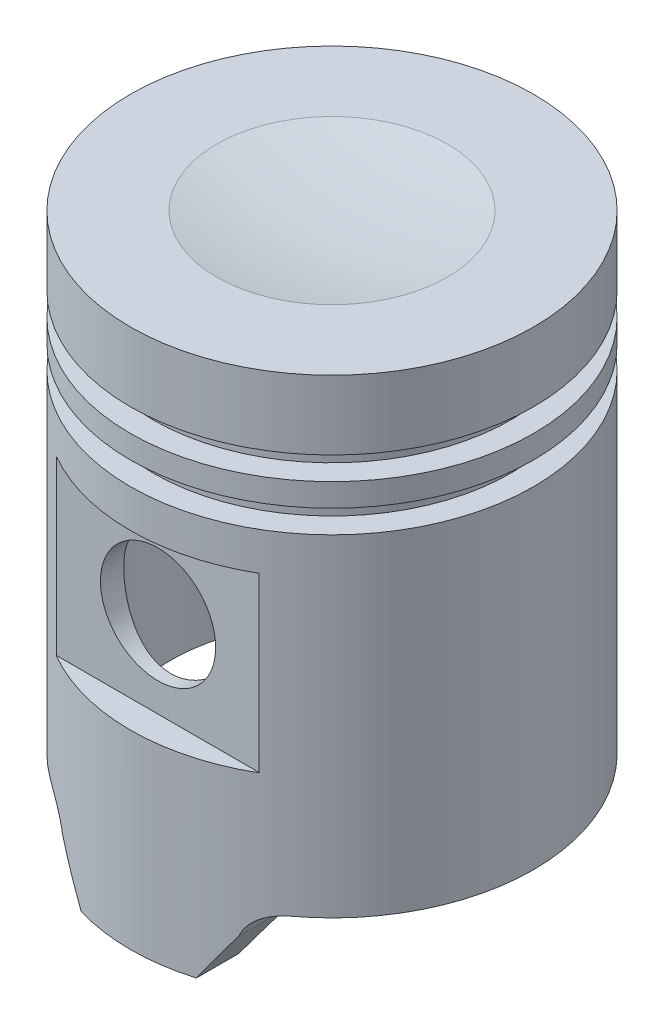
from build123d import *

# Parameters (mm, degrees)
SKETCH4_W               = 22.352
SKETCH4_H               = 19.05
CUT_EXTRUDE5_DEPTH      = 3.048
CUT_EXTRUDE6_REACH      = 76.775
CUT_EXTRUDE6_END_RADIUS = 17.78
SKETCH5_R               = 6.35
SKETCH7_W               = 22.352
SKETCH7_H               = 19.05
CUT_EXTRUDE7_DEPTH      = 3.048
CUT_EXTRUDE8_START      = -3.048
SKETCH8_R               = 6.35
CUT_EXTRUDE8_DEPTH      = 3.048
CUT_EXTRUDE9_DEPTH      = 77.505141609
CUT_EXTRUDE9_DEPTH_BACK = 77.505141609


with BuildPart() as part:
    # Sketch2 → Revolve1 (revolve)
    with BuildSketch(Plane(origin=(0, 0, 0), x_dir=(0, 0, -1), z_dir=(1, 0, 0)), mode=Mode.PRIVATE) as revolve1_sk:
        with BuildLine():
            Line((0, -6.35), (17.78, -6.35))
            Line((17.78, -6.35), (17.78, -58.166))
            Line((17.78, -58.166), (22.225, -58.166))
            Line((22.225, -58.166), (22.225, -38.481))
            Line((22.225, -38.481), (22.225, -19.431))
            Line((22.225, -19.431), (22.225, -13.97))
            Line((22.225, -13.97), (19.685, -13.97))
            Line((19.685, -13.97), (19.685, -11.43))
            Line((19.685, -11.43), (22.225, -11.43))
            Line((22.225, -11.43), (22.225, -8.89))
            Line((22.225, -8.89), (19.685, -8.89))
            Line((19.685, -8.89), (19.685, -6.35))
            Line((19.685, -6.35), (22.225, -6.35))
            Line((22.225, -6.35), (22.225, 1.27))
            Line((22.225, 1.27), (12.712693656, 1.27))
            ThreePointArc((12.712693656, 1.27), (6.387986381, 0.318288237), (0, 0))
            Line((0, 0), (0, -6.35))
        make_face()
    revolve(revolve1_sk.sketch.rotate(Axis((0, 74.511749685, 0), (0, -1, 0)), 180), axis=Axis((0, 74.511749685, 0), (0, -1, 0)))

    # Sketch4 → Cut-Extrude5 (cut)
    with BuildSketch(Plane.XY.offset(22.225)):
        with Locations((0, -27.686)):
            Rectangle(SKETCH4_W, SKETCH4_H)
    extrude(amount=-CUT_EXTRUDE5_DEPTH, mode=Mode.SUBTRACT)

    # Cut-Extrude6: up to this cylinder (the profile starts outside it)
    cut_extrude6_end = Plane(origin=(0, -27.686, 0), z_dir=(0, 1, 0)) * Cylinder(CUT_EXTRUDE6_END_RADIUS, 190.11, mode=Mode.PRIVATE)
    # Sketch5 → Cut-Extrude6 (cut, up to the surface)
    with BuildSketch(Plane.XY.offset(19.177), mode=Mode.PRIVATE) as cut_extrude6_sk1:
        with Locations((0, -27.686)):
            Circle(SKETCH5_R)
    cut_extrude6_tool1 = extrude(cut_extrude6_sk1.sketch, amount=-CUT_EXTRUDE6_REACH, mode=Mode.PRIVATE) - cut_extrude6_end
    add(cut_extrude6_tool1.solids().sort_by_distance((0, -27.686, 19.177))[0], mode=Mode.SUBTRACT)

    # Sketch7 → Cut-Extrude7 (cut)
    with BuildSketch(Plane(origin=(0, 0, -22.225), x_dir=(-1, 0, 0), z_dir=(0, 0, -1))):
        with Locations((0, -27.686)):
            Rectangle(SKETCH7_W, SKETCH7_H)
    extrude(amount=-CUT_EXTRUDE7_DEPTH, mode=Mode.SUBTRACT)

    # Sketch8 → Cut-Extrude8 (cut)
    with BuildSketch(Plane(origin=(0, 0, -19.177), x_dir=(-1, 0, 0), z_dir=(0, 0, -1)).offset(CUT_EXTRUDE8_START)):
        with Locations(Location((0, -27.686, 0), (0, 0, 180))):
            Circle(SKETCH8_R)
    extrude(amount=CUT_EXTRUDE8_DEPTH, mode=Mode.SUBTRACT)

    # Sketch10 → Cut-Extrude9 (cut, two sides: drawn at the far end of the back side and taken through both)
    with BuildSketch(Plane.XY.offset(22.225).offset(-CUT_EXTRUDE9_DEPTH_BACK)):
        with BuildLine():
            Line((-22.225, -58.166), (-6.35, -58.166))
            Line((-6.35, -58.166), (-9.739132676, -53.084209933))
            ThreePointArc((-9.739132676, -53.084209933), (-11.133078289, -51.241637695), (-13.335, -50.541853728))
            Line((-13.335, -50.541853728), (-22.225, -50.541853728))
            Line((-22.225, -50.541853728), (-22.225, -58.166))
        make_face()
        with BuildLine():
            Line((9.739132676, -53.084209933), (6.35, -58.166))
            Line((6.35, -58.166), (22.225, -58.166))
            Line((22.225, -58.166), (22.225, -50.541853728))
            Line((22.225, -50.541853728), (13.335, -50.541853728))
            ThreePointArc((13.335, -50.541853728), (11.133078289, -51.241637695), (9.739132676, -53.084209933))
        make_face()
    extrude(amount=CUT_EXTRUDE9_DEPTH + CUT_EXTRUDE9_DEPTH_BACK, mode=Mode.SUBTRACT)


solid = part.part
